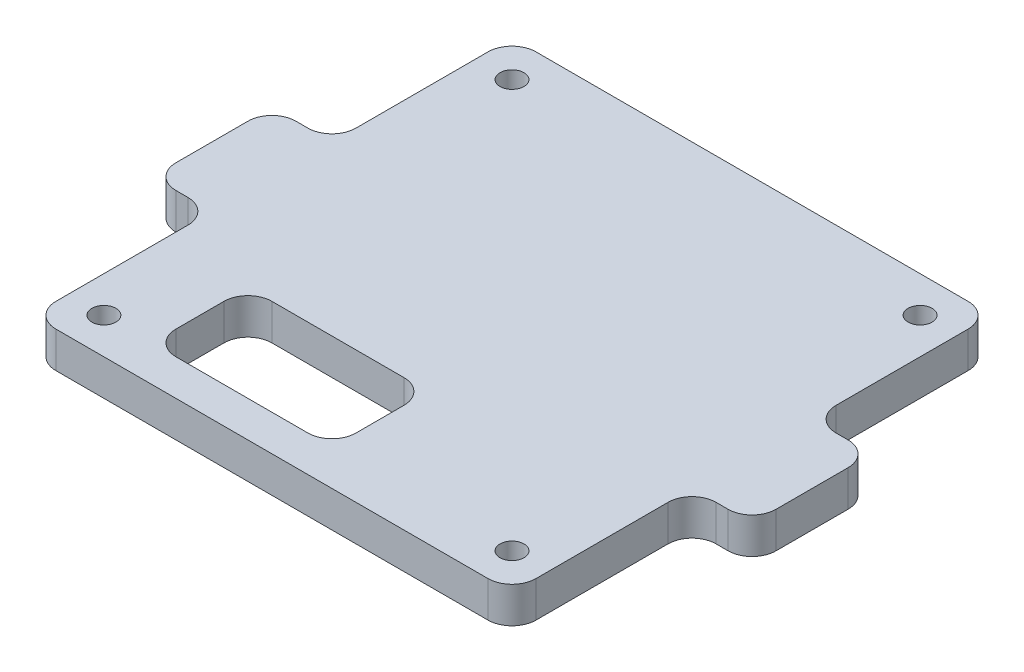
ISO-10303-21;
HEADER;
FILE_DESCRIPTION(('STEP AP214'),'2;1');
FILE_NAME('part.step','',(''),(''),'','','');
FILE_SCHEMA(('AUTOMOTIVE_DESIGN { 1 0 10303 214 1 1 1 1 }'));
ENDSEC;
DATA;
#1=APPLICATION_CONTEXT('core data for automotive mechanical design processes');
#2=APPLICATION_PROTOCOL_DEFINITION('international standard','automotive_design',2000,#1);
#3=PRODUCT_CONTEXT('',#1,'mechanical');
#4=PRODUCT('Part','Part','',(#3));
#5=PRODUCT_RELATED_PRODUCT_CATEGORY('part','',(#4));
#6=PRODUCT_DEFINITION_FORMATION('','',#4);
#7=PRODUCT_DEFINITION_CONTEXT('part definition',#1,'design');
#8=PRODUCT_DEFINITION('design','',#6,#7);
#9=PRODUCT_DEFINITION_SHAPE('','',#8);
#10=(LENGTH_UNIT() NAMED_UNIT(*) SI_UNIT(.MILLI.,.METRE.));
#11=(NAMED_UNIT(*) PLANE_ANGLE_UNIT() SI_UNIT($,.RADIAN.));
#12=(NAMED_UNIT(*) SI_UNIT($,.STERADIAN.) SOLID_ANGLE_UNIT());
#13=UNCERTAINTY_MEASURE_WITH_UNIT(LENGTH_MEASURE(1.E-05),#10,'distance_accuracy_value','');
#14=(GEOMETRIC_REPRESENTATION_CONTEXT(3) GLOBAL_UNCERTAINTY_ASSIGNED_CONTEXT((#13)) GLOBAL_UNIT_ASSIGNED_CONTEXT((#10,
#11,#12)) REPRESENTATION_CONTEXT('',''));
#15=CARTESIAN_POINT('',(0.,0.,0.));
#16=DIRECTION('',(0.,0.,1.));
#17=DIRECTION('',(1.,0.,0.));
#18=AXIS2_PLACEMENT_3D('',#15,#16,#17);
#19=CARTESIAN_POINT('',(0.,3.,0.));
#20=DIRECTION('',(0.,1.,0.));
#21=DIRECTION('',(0.,0.,1.));
#22=AXIS2_PLACEMENT_3D('',#19,#20,#21);
#23=PLANE('',#22);
#24=CARTESIAN_POINT('',(17.,3.,17.));
#25=DIRECTION('',(0.,1.,0.));
#26=DIRECTION('',(0.,0.,1.));
#27=AXIS2_PLACEMENT_3D('',#24,#25,#26);
#28=CIRCLE('',#27,1.);
#29=CARTESIAN_POINT('',(17.,3.,18.));
#30=VERTEX_POINT('',#29);
#31=EDGE_CURVE('E595',#30,#30,#28,.T.);
#32=ORIENTED_EDGE('',*,*,#31,.F.);
#33=EDGE_LOOP('',(#32));
#34=FACE_BOUND('',#33,.T.);
#35=CARTESIAN_POINT('',(17.,3.,-17.));
#36=DIRECTION('',(0.,1.,0.));
#37=DIRECTION('',(0.,0.,-1.));
#38=AXIS2_PLACEMENT_3D('',#35,#36,#37);
#39=CIRCLE('',#38,1.);
#40=CARTESIAN_POINT('',(17.,3.,-18.));
#41=VERTEX_POINT('',#40);
#42=EDGE_CURVE('E607',#41,#41,#39,.T.);
#43=ORIENTED_EDGE('',*,*,#42,.F.);
#44=EDGE_LOOP('',(#43));
#45=FACE_BOUND('',#44,.T.);
#46=DIRECTION('',(-1.,0.,0.));
#47=VECTOR('',#46,1.);
#48=CARTESIAN_POINT('',(20.,3.,-20.));
#49=LINE('',#48,#47);
#50=CARTESIAN_POINT('',(18.,3.,-20.));
#51=VERTEX_POINT('',#50);
#52=CARTESIAN_POINT('',(-18.,3.,-20.));
#53=VERTEX_POINT('',#52);
#54=EDGE_CURVE('E268',#51,#53,#49,.T.);
#55=ORIENTED_EDGE('',*,*,#54,.T.);
#56=CARTESIAN_POINT('',(-18.,3.,-18.));
#57=DIRECTION('',(0.,1.,0.));
#58=DIRECTION('',(0.,0.,1.));
#59=AXIS2_PLACEMENT_3D('',#56,#57,#58);
#60=CIRCLE('',#59,2.);
#61=CARTESIAN_POINT('',(-20.,3.,-18.));
#62=VERTEX_POINT('',#61);
#63=EDGE_CURVE('E332',#53,#62,#60,.T.);
#64=ORIENTED_EDGE('',*,*,#63,.T.);
#65=DIRECTION('',(0.,0.,1.));
#66=VECTOR('',#65,1.);
#67=CARTESIAN_POINT('',(-20.,3.,-5.));
#68=LINE('',#67,#66);
#69=CARTESIAN_POINT('',(-20.,3.,-7.));
#70=VERTEX_POINT('',#69);
#71=EDGE_CURVE('E430',#62,#70,#68,.T.);
#72=ORIENTED_EDGE('',*,*,#71,.T.);
#73=CARTESIAN_POINT('',(-22.,3.,-7.));
#74=DIRECTION('',(0.,1.,0.));
#75=DIRECTION('',(0.,0.,1.));
#76=AXIS2_PLACEMENT_3D('',#73,#74,#75);
#77=CIRCLE('',#76,2.);
#78=CARTESIAN_POINT('',(-22.,3.,-5.));
#79=VERTEX_POINT('',#78);
#80=EDGE_CURVE('E11',#70,#79,#77,.F.);
#81=ORIENTED_EDGE('',*,*,#80,.T.);
#82=DIRECTION('',(-1.,0.,0.));
#83=VECTOR('',#82,1.);
#84=CARTESIAN_POINT('',(-20.,3.,-5.));
#85=LINE('',#84,#83);
#86=CARTESIAN_POINT('',(-23.,3.,-5.));
#87=VERTEX_POINT('',#86);
#88=EDGE_CURVE('E428',#79,#87,#85,.T.);
#89=ORIENTED_EDGE('',*,*,#88,.T.);
#90=CARTESIAN_POINT('',(-23.,3.,-3.));
#91=DIRECTION('',(0.,1.,0.));
#92=DIRECTION('',(0.,0.,1.));
#93=AXIS2_PLACEMENT_3D('',#90,#91,#92);
#94=CIRCLE('',#93,2.);
#95=CARTESIAN_POINT('',(-25.,3.,-3.));
#96=VERTEX_POINT('',#95);
#97=EDGE_CURVE('E320',#87,#96,#94,.T.);
#98=ORIENTED_EDGE('',*,*,#97,.T.);
#99=DIRECTION('',(0.,0.,1.));
#100=VECTOR('',#99,1.);
#101=CARTESIAN_POINT('',(-25.,3.,5.));
#102=LINE('',#101,#100);
#103=CARTESIAN_POINT('',(-25.,3.,3.));
#104=VERTEX_POINT('',#103);
#105=EDGE_CURVE('E434',#96,#104,#102,.T.);
#106=ORIENTED_EDGE('',*,*,#105,.T.);
#107=CARTESIAN_POINT('',(-23.,3.,3.));
#108=DIRECTION('',(0.,1.,0.));
#109=DIRECTION('',(0.,0.,1.));
#110=AXIS2_PLACEMENT_3D('',#107,#108,#109);
#111=CIRCLE('',#110,2.);
#112=CARTESIAN_POINT('',(-23.,3.,5.));
#113=VERTEX_POINT('',#112);
#114=EDGE_CURVE('E322',#104,#113,#111,.T.);
#115=ORIENTED_EDGE('',*,*,#114,.T.);
#116=DIRECTION('',(1.,0.,0.));
#117=VECTOR('',#116,1.);
#118=CARTESIAN_POINT('',(-25.,3.,5.));
#119=LINE('',#118,#117);
#120=CARTESIAN_POINT('',(-22.,3.,5.));
#121=VERTEX_POINT('',#120);
#122=EDGE_CURVE('E437',#113,#121,#119,.T.);
#123=ORIENTED_EDGE('',*,*,#122,.T.);
#124=CARTESIAN_POINT('',(-22.,3.,7.));
#125=DIRECTION('',(0.,1.,0.));
#126=DIRECTION('',(0.,0.,1.));
#127=AXIS2_PLACEMENT_3D('',#124,#125,#126);
#128=CIRCLE('',#127,2.);
#129=CARTESIAN_POINT('',(-20.,3.,7.));
#130=VERTEX_POINT('',#129);
#131=EDGE_CURVE('E404',#121,#130,#128,.F.);
#132=ORIENTED_EDGE('',*,*,#131,.T.);
#133=DIRECTION('',(0.,0.,1.));
#134=VECTOR('',#133,1.);
#135=CARTESIAN_POINT('',(-20.,3.,20.));
#136=LINE('',#135,#134);
#137=CARTESIAN_POINT('',(-20.,3.,18.));
#138=VERTEX_POINT('',#137);
#139=EDGE_CURVE('E444',#130,#138,#136,.T.);
#140=ORIENTED_EDGE('',*,*,#139,.T.);
#141=CARTESIAN_POINT('',(-18.,3.,18.));
#142=DIRECTION('',(0.,1.,0.));
#143=DIRECTION('',(0.,0.,1.));
#144=AXIS2_PLACEMENT_3D('',#141,#142,#143);
#145=CIRCLE('',#144,2.);
#146=CARTESIAN_POINT('',(-18.,3.,20.));
#147=VERTEX_POINT('',#146);
#148=EDGE_CURVE('E324',#138,#147,#145,.T.);
#149=ORIENTED_EDGE('',*,*,#148,.T.);
#150=DIRECTION('',(1.,0.,0.));
#151=VECTOR('',#150,1.);
#152=CARTESIAN_POINT('',(20.,3.,20.));
#153=LINE('',#152,#151);
#154=CARTESIAN_POINT('',(18.,3.,20.));
#155=VERTEX_POINT('',#154);
#156=EDGE_CURVE('E447',#147,#155,#153,.T.);
#157=ORIENTED_EDGE('',*,*,#156,.T.);
#158=CARTESIAN_POINT('',(18.,3.,18.));
#159=DIRECTION('',(0.,1.,0.));
#160=DIRECTION('',(0.,0.,1.));
#161=AXIS2_PLACEMENT_3D('',#158,#159,#160);
#162=CIRCLE('',#161,2.);
#163=CARTESIAN_POINT('',(20.,3.,18.));
#164=VERTEX_POINT('',#163);
#165=EDGE_CURVE('E326',#155,#164,#162,.T.);
#166=ORIENTED_EDGE('',*,*,#165,.T.);
#167=DIRECTION('',(0.,0.,-1.));
#168=VECTOR('',#167,1.);
#169=CARTESIAN_POINT('',(20.,3.,20.));
#170=LINE('',#169,#168);
#171=CARTESIAN_POINT('',(20.,3.,7.));
#172=VERTEX_POINT('',#171);
#173=EDGE_CURVE('E450',#164,#172,#170,.T.);
#174=ORIENTED_EDGE('',*,*,#173,.T.);
#175=CARTESIAN_POINT('',(22.,3.,7.));
#176=DIRECTION('',(0.,1.,0.));
#177=DIRECTION('',(0.,0.,1.));
#178=AXIS2_PLACEMENT_3D('',#175,#176,#177);
#179=CIRCLE('',#178,2.);
#180=CARTESIAN_POINT('',(22.,3.,5.));
#181=VERTEX_POINT('',#180);
#182=EDGE_CURVE('E400',#172,#181,#179,.F.);
#183=ORIENTED_EDGE('',*,*,#182,.T.);
#184=DIRECTION('',(1.,0.,0.));
#185=VECTOR('',#184,1.);
#186=CARTESIAN_POINT('',(25.,3.,5.));
#187=LINE('',#186,#185);
#188=CARTESIAN_POINT('',(23.,3.,5.));
#189=VERTEX_POINT('',#188);
#190=EDGE_CURVE('E453',#181,#189,#187,.T.);
#191=ORIENTED_EDGE('',*,*,#190,.T.);
#192=CARTESIAN_POINT('',(23.,3.,3.));
#193=DIRECTION('',(0.,1.,0.));
#194=DIRECTION('',(0.,0.,1.));
#195=AXIS2_PLACEMENT_3D('',#192,#193,#194);
#196=CIRCLE('',#195,2.);
#197=CARTESIAN_POINT('',(25.,3.,3.));
#198=VERTEX_POINT('',#197);
#199=EDGE_CURVE('E328',#189,#198,#196,.T.);
#200=ORIENTED_EDGE('',*,*,#199,.T.);
#201=DIRECTION('',(0.,0.,-1.));
#202=VECTOR('',#201,1.);
#203=CARTESIAN_POINT('',(25.,3.,5.));
#204=LINE('',#203,#202);
#205=CARTESIAN_POINT('',(25.,3.,-3.));
#206=VERTEX_POINT('',#205);
#207=EDGE_CURVE('E456',#198,#206,#204,.T.);
#208=ORIENTED_EDGE('',*,*,#207,.T.);
#209=CARTESIAN_POINT('',(23.,3.,-3.));
#210=DIRECTION('',(0.,1.,0.));
#211=DIRECTION('',(0.,0.,1.));
#212=AXIS2_PLACEMENT_3D('',#209,#210,#211);
#213=CIRCLE('',#212,2.);
#214=CARTESIAN_POINT('',(23.,3.,-5.));
#215=VERTEX_POINT('',#214);
#216=EDGE_CURVE('E330',#206,#215,#213,.T.);
#217=ORIENTED_EDGE('',*,*,#216,.T.);
#218=DIRECTION('',(-1.,0.,0.));
#219=VECTOR('',#218,1.);
#220=CARTESIAN_POINT('',(25.,3.,-5.));
#221=LINE('',#220,#219);
#222=CARTESIAN_POINT('',(22.,3.,-5.));
#223=VERTEX_POINT('',#222);
#224=EDGE_CURVE('E459',#215,#223,#221,.T.);
#225=ORIENTED_EDGE('',*,*,#224,.T.);
#226=CARTESIAN_POINT('',(22.,3.,-7.));
#227=DIRECTION('',(0.,1.,0.));
#228=DIRECTION('',(0.,0.,1.));
#229=AXIS2_PLACEMENT_3D('',#226,#227,#228);
#230=CIRCLE('',#229,2.);
#231=CARTESIAN_POINT('',(20.,3.,-7.));
#232=VERTEX_POINT('',#231);
#233=EDGE_CURVE('E54',#223,#232,#230,.F.);
#234=ORIENTED_EDGE('',*,*,#233,.T.);
#235=DIRECTION('',(0.,0.,-1.));
#236=VECTOR('',#235,1.);
#237=CARTESIAN_POINT('',(20.,3.,-5.));
#238=LINE('',#237,#236);
#239=CARTESIAN_POINT('',(20.,3.,-18.));
#240=VERTEX_POINT('',#239);
#241=EDGE_CURVE('E273',#232,#240,#238,.T.);
#242=ORIENTED_EDGE('',*,*,#241,.T.);
#243=CARTESIAN_POINT('',(18.,3.,-18.));
#244=DIRECTION('',(0.,1.,0.));
#245=DIRECTION('',(0.,0.,1.));
#246=AXIS2_PLACEMENT_3D('',#243,#244,#245);
#247=CIRCLE('',#246,2.);
#248=EDGE_CURVE('E318',#240,#51,#247,.T.);
#249=ORIENTED_EDGE('',*,*,#248,.T.);
#250=EDGE_LOOP('',(#55,#64,#72,#81,#89,#98,#106,#115,#123,#132,#140,#149,#157,#166,#174,#183,
#191,#200,#208,#217,#225,#234,#242,#249));
#251=FACE_BOUND('',#250,.T.);
#252=CARTESIAN_POINT('',(-17.,3.,-17.));
#253=DIRECTION('',(0.,1.,0.));
#254=DIRECTION('',(0.,0.,1.));
#255=AXIS2_PLACEMENT_3D('',#252,#253,#254);
#256=CIRCLE('',#255,1.);
#257=CARTESIAN_POINT('',(-17.,3.,-16.));
#258=VERTEX_POINT('',#257);
#259=EDGE_CURVE('E421',#258,#258,#256,.T.);
#260=ORIENTED_EDGE('',*,*,#259,.F.);
#261=EDGE_LOOP('',(#260));
#262=FACE_BOUND('',#261,.T.);
#263=CARTESIAN_POINT('',(-17.,3.,17.));
#264=DIRECTION('',(0.,1.,0.));
#265=DIRECTION('',(0.,0.,-1.));
#266=AXIS2_PLACEMENT_3D('',#263,#264,#265);
#267=CIRCLE('',#266,1.);
#268=CARTESIAN_POINT('',(-17.,3.,16.));
#269=VERTEX_POINT('',#268);
#270=EDGE_CURVE('E601',#269,#269,#267,.T.);
#271=ORIENTED_EDGE('',*,*,#270,.F.);
#272=EDGE_LOOP('',(#271));
#273=FACE_BOUND('',#272,.T.);
#274=DIRECTION('',(1.,0.,0.));
#275=VECTOR('',#274,1.);
#276=CARTESIAN_POINT('',(-13.,3.,17.));
#277=LINE('',#276,#275);
#278=CARTESIAN_POINT('',(-11.,3.,17.));
#279=VERTEX_POINT('',#278);
#280=CARTESIAN_POINT('',(0.,3.,17.));
#281=VERTEX_POINT('',#280);
#282=EDGE_CURVE('E586',#279,#281,#277,.T.);
#283=ORIENTED_EDGE('',*,*,#282,.F.);
#284=CARTESIAN_POINT('',(-11.,3.,15.));
#285=DIRECTION('',(0.,1.,0.));
#286=DIRECTION('',(0.,0.,1.));
#287=AXIS2_PLACEMENT_3D('',#284,#285,#286);
#288=CIRCLE('',#287,2.);
#289=CARTESIAN_POINT('',(-13.,3.,15.));
#290=VERTEX_POINT('',#289);
#291=EDGE_CURVE('E253',#279,#290,#288,.F.);
#292=ORIENTED_EDGE('',*,*,#291,.T.);
#293=DIRECTION('',(0.,0.,1.));
#294=VECTOR('',#293,1.);
#295=CARTESIAN_POINT('',(-13.,3.,17.));
#296=LINE('',#295,#294);
#297=CARTESIAN_POINT('',(-13.,3.,11.));
#298=VERTEX_POINT('',#297);
#299=EDGE_CURVE('E572',#298,#290,#296,.T.);
#300=ORIENTED_EDGE('',*,*,#299,.F.);
#301=CARTESIAN_POINT('',(-11.,3.,11.));
#302=DIRECTION('',(0.,1.,0.));
#303=DIRECTION('',(0.,0.,1.));
#304=AXIS2_PLACEMENT_3D('',#301,#302,#303);
#305=CIRCLE('',#304,2.);
#306=CARTESIAN_POINT('',(-11.,3.,9.00000000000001));
#307=VERTEX_POINT('',#306);
#308=EDGE_CURVE('E254',#298,#307,#305,.F.);
#309=ORIENTED_EDGE('',*,*,#308,.T.);
#310=DIRECTION('',(-1.,0.,0.));
#311=VECTOR('',#310,1.);
#312=CARTESIAN_POINT('',(-13.,3.,9.00000000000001));
#313=LINE('',#312,#311);
#314=CARTESIAN_POINT('',(0.,3.,9.00000000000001));
#315=VERTEX_POINT('',#314);
#316=EDGE_CURVE('E582',#315,#307,#313,.T.);
#317=ORIENTED_EDGE('',*,*,#316,.F.);
#318=CARTESIAN_POINT('',(0.,3.,11.));
#319=DIRECTION('',(0.,1.,0.));
#320=DIRECTION('',(0.,0.,1.));
#321=AXIS2_PLACEMENT_3D('',#318,#319,#320);
#322=CIRCLE('',#321,2.);
#323=CARTESIAN_POINT('',(2.,3.,11.));
#324=VERTEX_POINT('',#323);
#325=EDGE_CURVE('E389',#315,#324,#322,.F.);
#326=ORIENTED_EDGE('',*,*,#325,.T.);
#327=DIRECTION('',(0.,0.,-1.));
#328=VECTOR('',#327,1.);
#329=CARTESIAN_POINT('',(2.,3.,17.));
#330=LINE('',#329,#328);
#331=CARTESIAN_POINT('',(2.,3.,15.));
#332=VERTEX_POINT('',#331);
#333=EDGE_CURVE('E580',#332,#324,#330,.T.);
#334=ORIENTED_EDGE('',*,*,#333,.F.);
#335=CARTESIAN_POINT('',(0.,3.,15.));
#336=DIRECTION('',(0.,1.,0.));
#337=DIRECTION('',(0.,0.,1.));
#338=AXIS2_PLACEMENT_3D('',#335,#336,#337);
#339=CIRCLE('',#338,2.);
#340=EDGE_CURVE('E385',#332,#281,#339,.F.);
#341=ORIENTED_EDGE('',*,*,#340,.T.);
#342=EDGE_LOOP('',(#283,#292,#300,#309,#317,#326,#334,#341));
#343=FACE_BOUND('',#342,.T.);
#344=ADVANCED_FACE('F32',(#34,#45,#251,#262,#273,#343),#23,.T.);
#345=CARTESIAN_POINT('',(0.,0.,0.));
#346=DIRECTION('',(0.,1.,0.));
#347=DIRECTION('',(0.,0.,1.));
#348=AXIS2_PLACEMENT_3D('',#345,#346,#347);
#349=PLANE('',#348);
#350=CARTESIAN_POINT('',(17.,0.,17.));
#351=DIRECTION('',(0.,1.,0.));
#352=DIRECTION('',(0.,0.,1.));
#353=AXIS2_PLACEMENT_3D('',#350,#351,#352);
#354=CIRCLE('',#353,1.);
#355=CARTESIAN_POINT('',(17.,0.,18.));
#356=VERTEX_POINT('',#355);
#357=EDGE_CURVE('E588',#356,#356,#354,.T.);
#358=ORIENTED_EDGE('',*,*,#357,.T.);
#359=EDGE_LOOP('',(#358));
#360=FACE_BOUND('',#359,.T.);
#361=CARTESIAN_POINT('',(17.,0.,-17.));
#362=DIRECTION('',(0.,1.,0.));
#363=DIRECTION('',(0.,0.,-1.));
#364=AXIS2_PLACEMENT_3D('',#361,#362,#363);
#365=CIRCLE('',#364,1.);
#366=CARTESIAN_POINT('',(17.,0.,-18.));
#367=VERTEX_POINT('',#366);
#368=EDGE_CURVE('E604',#367,#367,#365,.T.);
#369=ORIENTED_EDGE('',*,*,#368,.T.);
#370=EDGE_LOOP('',(#369));
#371=FACE_BOUND('',#370,.T.);
#372=DIRECTION('',(0.,0.,1.));
#373=VECTOR('',#372,1.);
#374=CARTESIAN_POINT('',(-20.,0.,-5.));
#375=LINE('',#374,#373);
#376=CARTESIAN_POINT('',(-20.,0.,-18.));
#377=VERTEX_POINT('',#376);
#378=CARTESIAN_POINT('',(-20.,0.,-7.));
#379=VERTEX_POINT('',#378);
#380=EDGE_CURVE('E410',#377,#379,#375,.T.);
#381=ORIENTED_EDGE('',*,*,#380,.F.);
#382=CARTESIAN_POINT('',(-18.,0.,-18.));
#383=DIRECTION('',(0.,1.,0.));
#384=DIRECTION('',(0.,0.,1.));
#385=AXIS2_PLACEMENT_3D('',#382,#383,#384);
#386=CIRCLE('',#385,2.);
#387=CARTESIAN_POINT('',(-18.,0.,-20.));
#388=VERTEX_POINT('',#387);
#389=EDGE_CURVE('E311',#377,#388,#386,.F.);
#390=ORIENTED_EDGE('',*,*,#389,.T.);
#391=DIRECTION('',(-1.,0.,0.));
#392=VECTOR('',#391,1.);
#393=CARTESIAN_POINT('',(20.,0.,-20.));
#394=LINE('',#393,#392);
#395=CARTESIAN_POINT('',(18.,0.,-20.));
#396=VERTEX_POINT('',#395);
#397=EDGE_CURVE('E276',#396,#388,#394,.T.);
#398=ORIENTED_EDGE('',*,*,#397,.F.);
#399=CARTESIAN_POINT('',(18.,0.,-18.));
#400=DIRECTION('',(0.,1.,0.));
#401=DIRECTION('',(0.,0.,1.));
#402=AXIS2_PLACEMENT_3D('',#399,#400,#401);
#403=CIRCLE('',#402,2.);
#404=CARTESIAN_POINT('',(20.,0.,-18.));
#405=VERTEX_POINT('',#404);
#406=EDGE_CURVE('E297',#396,#405,#403,.F.);
#407=ORIENTED_EDGE('',*,*,#406,.T.);
#408=DIRECTION('',(0.,0.,-1.));
#409=VECTOR('',#408,1.);
#410=CARTESIAN_POINT('',(20.,0.,-5.));
#411=LINE('',#410,#409);
#412=CARTESIAN_POINT('',(20.,0.,-7.));
#413=VERTEX_POINT('',#412);
#414=EDGE_CURVE('E486',#413,#405,#411,.T.);
#415=ORIENTED_EDGE('',*,*,#414,.F.);
#416=CARTESIAN_POINT('',(22.,0.,-7.));
#417=DIRECTION('',(0.,1.,0.));
#418=DIRECTION('',(0.,0.,1.));
#419=AXIS2_PLACEMENT_3D('',#416,#417,#418);
#420=CIRCLE('',#419,2.);
#421=CARTESIAN_POINT('',(22.,0.,-5.));
#422=VERTEX_POINT('',#421);
#423=EDGE_CURVE('E395',#413,#422,#420,.T.);
#424=ORIENTED_EDGE('',*,*,#423,.T.);
#425=DIRECTION('',(-1.,0.,0.));
#426=VECTOR('',#425,1.);
#427=CARTESIAN_POINT('',(25.,0.,-5.));
#428=LINE('',#427,#426);
#429=CARTESIAN_POINT('',(23.,0.,-5.));
#430=VERTEX_POINT('',#429);
#431=EDGE_CURVE('E484',#430,#422,#428,.T.);
#432=ORIENTED_EDGE('',*,*,#431,.F.);
#433=CARTESIAN_POINT('',(23.,0.,-3.));
#434=DIRECTION('',(0.,1.,0.));
#435=DIRECTION('',(0.,0.,1.));
#436=AXIS2_PLACEMENT_3D('',#433,#434,#435);
#437=CIRCLE('',#436,2.);
#438=CARTESIAN_POINT('',(25.,0.,-3.));
#439=VERTEX_POINT('',#438);
#440=EDGE_CURVE('E309',#430,#439,#437,.F.);
#441=ORIENTED_EDGE('',*,*,#440,.T.);
#442=DIRECTION('',(0.,0.,-1.));
#443=VECTOR('',#442,1.);
#444=CARTESIAN_POINT('',(25.,0.,5.));
#445=LINE('',#444,#443);
#446=CARTESIAN_POINT('',(25.,0.,3.));
#447=VERTEX_POINT('',#446);
#448=EDGE_CURVE('E481',#447,#439,#445,.T.);
#449=ORIENTED_EDGE('',*,*,#448,.F.);
#450=CARTESIAN_POINT('',(23.,0.,3.));
#451=DIRECTION('',(0.,1.,0.));
#452=DIRECTION('',(0.,0.,1.));
#453=AXIS2_PLACEMENT_3D('',#450,#451,#452);
#454=CIRCLE('',#453,2.);
#455=CARTESIAN_POINT('',(23.,0.,5.));
#456=VERTEX_POINT('',#455);
#457=EDGE_CURVE('E307',#447,#456,#454,.F.);
#458=ORIENTED_EDGE('',*,*,#457,.T.);
#459=DIRECTION('',(1.,0.,0.));
#460=VECTOR('',#459,1.);
#461=CARTESIAN_POINT('',(25.,0.,5.));
#462=LINE('',#461,#460);
#463=CARTESIAN_POINT('',(22.,0.,5.));
#464=VERTEX_POINT('',#463);
#465=EDGE_CURVE('E478',#464,#456,#462,.T.);
#466=ORIENTED_EDGE('',*,*,#465,.F.);
#467=CARTESIAN_POINT('',(22.,0.,7.));
#468=DIRECTION('',(0.,1.,0.));
#469=DIRECTION('',(0.,0.,1.));
#470=AXIS2_PLACEMENT_3D('',#467,#468,#469);
#471=CIRCLE('',#470,2.);
#472=CARTESIAN_POINT('',(20.,0.,7.));
#473=VERTEX_POINT('',#472);
#474=EDGE_CURVE('E398',#464,#473,#471,.T.);
#475=ORIENTED_EDGE('',*,*,#474,.T.);
#476=DIRECTION('',(0.,0.,-1.));
#477=VECTOR('',#476,1.);
#478=CARTESIAN_POINT('',(20.,0.,20.));
#479=LINE('',#478,#477);
#480=CARTESIAN_POINT('',(20.,0.,18.));
#481=VERTEX_POINT('',#480);
#482=EDGE_CURVE('E475',#481,#473,#479,.T.);
#483=ORIENTED_EDGE('',*,*,#482,.F.);
#484=CARTESIAN_POINT('',(18.,0.,18.));
#485=DIRECTION('',(0.,1.,0.));
#486=DIRECTION('',(0.,0.,1.));
#487=AXIS2_PLACEMENT_3D('',#484,#485,#486);
#488=CIRCLE('',#487,2.);
#489=CARTESIAN_POINT('',(18.,0.,20.));
#490=VERTEX_POINT('',#489);
#491=EDGE_CURVE('E305',#481,#490,#488,.F.);
#492=ORIENTED_EDGE('',*,*,#491,.T.);
#493=DIRECTION('',(1.,0.,0.));
#494=VECTOR('',#493,1.);
#495=CARTESIAN_POINT('',(20.,0.,20.));
#496=LINE('',#495,#494);
#497=CARTESIAN_POINT('',(-18.,0.,20.));
#498=VERTEX_POINT('',#497);
#499=EDGE_CURVE('E472',#498,#490,#496,.T.);
#500=ORIENTED_EDGE('',*,*,#499,.F.);
#501=CARTESIAN_POINT('',(-18.,0.,18.));
#502=DIRECTION('',(0.,1.,0.));
#503=DIRECTION('',(0.,0.,1.));
#504=AXIS2_PLACEMENT_3D('',#501,#502,#503);
#505=CIRCLE('',#504,2.);
#506=CARTESIAN_POINT('',(-20.,0.,18.));
#507=VERTEX_POINT('',#506);
#508=EDGE_CURVE('E303',#498,#507,#505,.F.);
#509=ORIENTED_EDGE('',*,*,#508,.T.);
#510=DIRECTION('',(0.,0.,1.));
#511=VECTOR('',#510,1.);
#512=CARTESIAN_POINT('',(-20.,0.,20.));
#513=LINE('',#512,#511);
#514=CARTESIAN_POINT('',(-20.,0.,7.));
#515=VERTEX_POINT('',#514);
#516=EDGE_CURVE('E469',#515,#507,#513,.T.);
#517=ORIENTED_EDGE('',*,*,#516,.F.);
#518=CARTESIAN_POINT('',(-22.,0.,7.));
#519=DIRECTION('',(0.,1.,0.));
#520=DIRECTION('',(0.,0.,1.));
#521=AXIS2_PLACEMENT_3D('',#518,#519,#520);
#522=CIRCLE('',#521,2.);
#523=CARTESIAN_POINT('',(-22.,0.,5.));
#524=VERTEX_POINT('',#523);
#525=EDGE_CURVE('E402',#515,#524,#522,.T.);
#526=ORIENTED_EDGE('',*,*,#525,.T.);
#527=DIRECTION('',(1.,0.,0.));
#528=VECTOR('',#527,1.);
#529=CARTESIAN_POINT('',(-25.,0.,5.));
#530=LINE('',#529,#528);
#531=CARTESIAN_POINT('',(-23.,0.,5.));
#532=VERTEX_POINT('',#531);
#533=EDGE_CURVE('E466',#532,#524,#530,.T.);
#534=ORIENTED_EDGE('',*,*,#533,.F.);
#535=CARTESIAN_POINT('',(-23.,0.,3.));
#536=DIRECTION('',(0.,1.,0.));
#537=DIRECTION('',(0.,0.,1.));
#538=AXIS2_PLACEMENT_3D('',#535,#536,#537);
#539=CIRCLE('',#538,2.);
#540=CARTESIAN_POINT('',(-25.,0.,3.));
#541=VERTEX_POINT('',#540);
#542=EDGE_CURVE('E301',#532,#541,#539,.F.);
#543=ORIENTED_EDGE('',*,*,#542,.T.);
#544=DIRECTION('',(0.,0.,1.));
#545=VECTOR('',#544,1.);
#546=CARTESIAN_POINT('',(-25.,0.,5.));
#547=LINE('',#546,#545);
#548=CARTESIAN_POINT('',(-25.,0.,-3.));
#549=VERTEX_POINT('',#548);
#550=EDGE_CURVE('E463',#549,#541,#547,.T.);
#551=ORIENTED_EDGE('',*,*,#550,.F.);
#552=CARTESIAN_POINT('',(-23.,0.,-3.));
#553=DIRECTION('',(0.,1.,0.));
#554=DIRECTION('',(0.,0.,1.));
#555=AXIS2_PLACEMENT_3D('',#552,#553,#554);
#556=CIRCLE('',#555,2.);
#557=CARTESIAN_POINT('',(-23.,0.,-5.));
#558=VERTEX_POINT('',#557);
#559=EDGE_CURVE('E299',#549,#558,#556,.F.);
#560=ORIENTED_EDGE('',*,*,#559,.T.);
#561=DIRECTION('',(-1.,0.,0.));
#562=VECTOR('',#561,1.);
#563=CARTESIAN_POINT('',(-20.,0.,-5.));
#564=LINE('',#563,#562);
#565=CARTESIAN_POINT('',(-22.,0.,-5.));
#566=VERTEX_POINT('',#565);
#567=EDGE_CURVE('E412',#566,#558,#564,.T.);
#568=ORIENTED_EDGE('',*,*,#567,.F.);
#569=CARTESIAN_POINT('',(-22.,0.,-7.));
#570=DIRECTION('',(0.,1.,0.));
#571=DIRECTION('',(0.,0.,1.));
#572=AXIS2_PLACEMENT_3D('',#569,#570,#571);
#573=CIRCLE('',#572,2.);
#574=EDGE_CURVE('E40',#566,#379,#573,.T.);
#575=ORIENTED_EDGE('',*,*,#574,.T.);
#576=EDGE_LOOP('',(#381,#390,#398,#407,#415,#424,#432,#441,#449,#458,#466,#475,#483,#492,#500,
#509,#517,#526,#534,#543,#551,#560,#568,#575));
#577=FACE_BOUND('',#576,.T.);
#578=CARTESIAN_POINT('',(-17.,0.,-17.));
#579=DIRECTION('',(0.,1.,0.));
#580=DIRECTION('',(0.,0.,1.));
#581=AXIS2_PLACEMENT_3D('',#578,#579,#580);
#582=CIRCLE('',#581,1.);
#583=CARTESIAN_POINT('',(-17.,0.,-16.));
#584=VERTEX_POINT('',#583);
#585=EDGE_CURVE('E610',#584,#584,#582,.T.);
#586=ORIENTED_EDGE('',*,*,#585,.T.);
#587=EDGE_LOOP('',(#586));
#588=FACE_BOUND('',#587,.T.);
#589=CARTESIAN_POINT('',(-17.,0.,17.));
#590=DIRECTION('',(0.,1.,0.));
#591=DIRECTION('',(0.,0.,-1.));
#592=AXIS2_PLACEMENT_3D('',#589,#590,#591);
#593=CIRCLE('',#592,1.);
#594=CARTESIAN_POINT('',(-17.,0.,16.));
#595=VERTEX_POINT('',#594);
#596=EDGE_CURVE('E598',#595,#595,#593,.T.);
#597=ORIENTED_EDGE('',*,*,#596,.T.);
#598=EDGE_LOOP('',(#597));
#599=FACE_BOUND('',#598,.T.);
#600=DIRECTION('',(-1.,0.,0.));
#601=VECTOR('',#600,1.);
#602=CARTESIAN_POINT('',(-13.,0.,9.00000000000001));
#603=LINE('',#602,#601);
#604=CARTESIAN_POINT('',(0.,0.,9.00000000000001));
#605=VERTEX_POINT('',#604);
#606=CARTESIAN_POINT('',(-11.,0.,9.00000000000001));
#607=VERTEX_POINT('',#606);
#608=EDGE_CURVE('E567',#605,#607,#603,.T.);
#609=ORIENTED_EDGE('',*,*,#608,.T.);
#610=CARTESIAN_POINT('',(-11.,0.,11.));
#611=DIRECTION('',(0.,1.,0.));
#612=DIRECTION('',(0.,0.,1.));
#613=AXIS2_PLACEMENT_3D('',#610,#611,#612);
#614=CIRCLE('',#613,2.);
#615=CARTESIAN_POINT('',(-13.,0.,11.));
#616=VERTEX_POINT('',#615);
#617=EDGE_CURVE('E391',#607,#616,#614,.T.);
#618=ORIENTED_EDGE('',*,*,#617,.T.);
#619=DIRECTION('',(0.,0.,1.));
#620=VECTOR('',#619,1.);
#621=CARTESIAN_POINT('',(-13.,0.,17.));
#622=LINE('',#621,#620);
#623=CARTESIAN_POINT('',(-13.,0.,15.));
#624=VERTEX_POINT('',#623);
#625=EDGE_CURVE('E248',#616,#624,#622,.T.);
#626=ORIENTED_EDGE('',*,*,#625,.T.);
#627=CARTESIAN_POINT('',(-11.,0.,15.));
#628=DIRECTION('',(0.,1.,0.));
#629=DIRECTION('',(0.,0.,1.));
#630=AXIS2_PLACEMENT_3D('',#627,#628,#629);
#631=CIRCLE('',#630,2.);
#632=CARTESIAN_POINT('',(-11.,0.,17.));
#633=VERTEX_POINT('',#632);
#634=EDGE_CURVE('E242',#624,#633,#631,.T.);
#635=ORIENTED_EDGE('',*,*,#634,.T.);
#636=DIRECTION('',(1.,0.,0.));
#637=VECTOR('',#636,1.);
#638=CARTESIAN_POINT('',(-13.,0.,17.));
#639=LINE('',#638,#637);
#640=CARTESIAN_POINT('',(0.,0.,17.));
#641=VERTEX_POINT('',#640);
#642=EDGE_CURVE('E246',#633,#641,#639,.T.);
#643=ORIENTED_EDGE('',*,*,#642,.T.);
#644=CARTESIAN_POINT('',(0.,0.,15.));
#645=DIRECTION('',(0.,1.,0.));
#646=DIRECTION('',(0.,0.,1.));
#647=AXIS2_PLACEMENT_3D('',#644,#645,#646);
#648=CIRCLE('',#647,2.);
#649=CARTESIAN_POINT('',(2.,0.,15.));
#650=VERTEX_POINT('',#649);
#651=EDGE_CURVE('E383',#641,#650,#648,.T.);
#652=ORIENTED_EDGE('',*,*,#651,.T.);
#653=DIRECTION('',(0.,0.,-1.));
#654=VECTOR('',#653,1.);
#655=CARTESIAN_POINT('',(2.,0.,17.));
#656=LINE('',#655,#654);
#657=CARTESIAN_POINT('',(2.,0.,11.));
#658=VERTEX_POINT('',#657);
#659=EDGE_CURVE('E264',#650,#658,#656,.T.);
#660=ORIENTED_EDGE('',*,*,#659,.T.);
#661=CARTESIAN_POINT('',(0.,0.,11.));
#662=DIRECTION('',(0.,1.,0.));
#663=DIRECTION('',(0.,0.,1.));
#664=AXIS2_PLACEMENT_3D('',#661,#662,#663);
#665=CIRCLE('',#664,2.);
#666=EDGE_CURVE('E387',#658,#605,#665,.T.);
#667=ORIENTED_EDGE('',*,*,#666,.T.);
#668=EDGE_LOOP('',(#609,#618,#626,#635,#643,#652,#660,#667));
#669=FACE_BOUND('',#668,.T.);
#670=ADVANCED_FACE('F245',(#360,#371,#577,#588,#599,#669),#349,.F.);
#671=CARTESIAN_POINT('',(-20.,3.,-5.));
#672=DIRECTION('',(1.,0.,0.));
#673=DIRECTION('',(0.,0.,-1.));
#674=AXIS2_PLACEMENT_3D('',#671,#672,#673);
#675=PLANE('',#674);
#676=ORIENTED_EDGE('',*,*,#71,.F.);
#677=DIRECTION('',(0.,-1.,0.));
#678=VECTOR('',#677,1.);
#679=CARTESIAN_POINT('',(-20.,3.,-18.));
#680=LINE('',#679,#678);
#681=EDGE_CURVE('E294',#62,#377,#680,.T.);
#682=ORIENTED_EDGE('',*,*,#681,.T.);
#683=ORIENTED_EDGE('',*,*,#380,.T.);
#684=DIRECTION('',(0.,-1.,0.));
#685=VECTOR('',#684,1.);
#686=CARTESIAN_POINT('',(-20.,3.,-7.));
#687=LINE('',#686,#685);
#688=EDGE_CURVE('E292',#379,#70,#687,.F.);
#689=ORIENTED_EDGE('',*,*,#688,.T.);
#690=EDGE_LOOP('',(#676,#682,#683,#689));
#691=FACE_BOUND('',#690,.T.);
#692=ADVANCED_FACE('F418',(#691),#675,.F.);
#693=CARTESIAN_POINT('',(-20.,3.,-5.));
#694=DIRECTION('',(0.,0.,1.));
#695=DIRECTION('',(1.,0.,0.));
#696=AXIS2_PLACEMENT_3D('',#693,#694,#695);
#697=PLANE('',#696);
#698=ORIENTED_EDGE('',*,*,#567,.T.);
#699=DIRECTION('',(0.,-1.,0.));
#700=VECTOR('',#699,1.);
#701=CARTESIAN_POINT('',(-23.,3.,-5.));
#702=LINE('',#701,#700);
#703=EDGE_CURVE('E381',#558,#87,#702,.F.);
#704=ORIENTED_EDGE('',*,*,#703,.T.);
#705=ORIENTED_EDGE('',*,*,#88,.F.);
#706=DIRECTION('',(0.,-1.,0.));
#707=VECTOR('',#706,1.);
#708=CARTESIAN_POINT('',(-22.,0.,-5.));
#709=LINE('',#708,#707);
#710=EDGE_CURVE('E378',#79,#566,#709,.T.);
#711=ORIENTED_EDGE('',*,*,#710,.T.);
#712=EDGE_LOOP('',(#698,#704,#705,#711));
#713=FACE_BOUND('',#712,.T.);
#714=ADVANCED_FACE('F432',(#713),#697,.F.);
#715=CARTESIAN_POINT('',(-25.,3.,5.));
#716=DIRECTION('',(1.,0.,0.));
#717=DIRECTION('',(0.,0.,-1.));
#718=AXIS2_PLACEMENT_3D('',#715,#716,#717);
#719=PLANE('',#718);
#720=ORIENTED_EDGE('',*,*,#550,.T.);
#721=DIRECTION('',(0.,-1.,0.));
#722=VECTOR('',#721,1.);
#723=CARTESIAN_POINT('',(-25.,3.,3.));
#724=LINE('',#723,#722);
#725=EDGE_CURVE('E376',#541,#104,#724,.F.);
#726=ORIENTED_EDGE('',*,*,#725,.T.);
#727=ORIENTED_EDGE('',*,*,#105,.F.);
#728=DIRECTION('',(0.,-1.,0.));
#729=VECTOR('',#728,1.);
#730=CARTESIAN_POINT('',(-25.,3.,-3.));
#731=LINE('',#730,#729);
#732=EDGE_CURVE('E373',#96,#549,#731,.T.);
#733=ORIENTED_EDGE('',*,*,#732,.T.);
#734=EDGE_LOOP('',(#720,#726,#727,#733));
#735=FACE_BOUND('',#734,.T.);
#736=ADVANCED_FACE('F870',(#735),#719,.F.);
#737=CARTESIAN_POINT('',(-25.,3.,5.));
#738=DIRECTION('',(0.,0.,-1.));
#739=DIRECTION('',(-1.,0.,0.));
#740=AXIS2_PLACEMENT_3D('',#737,#738,#739);
#741=PLANE('',#740);
#742=ORIENTED_EDGE('',*,*,#533,.T.);
#743=DIRECTION('',(0.,-1.,0.));
#744=VECTOR('',#743,1.);
#745=CARTESIAN_POINT('',(-22.,3.,5.));
#746=LINE('',#745,#744);
#747=EDGE_CURVE('E371',#524,#121,#746,.F.);
#748=ORIENTED_EDGE('',*,*,#747,.T.);
#749=ORIENTED_EDGE('',*,*,#122,.F.);
#750=DIRECTION('',(0.,-1.,0.));
#751=VECTOR('',#750,1.);
#752=CARTESIAN_POINT('',(-23.,3.,5.));
#753=LINE('',#752,#751);
#754=EDGE_CURVE('E368',#113,#532,#753,.T.);
#755=ORIENTED_EDGE('',*,*,#754,.T.);
#756=EDGE_LOOP('',(#742,#748,#749,#755));
#757=FACE_BOUND('',#756,.T.);
#758=ADVANCED_FACE('F860',(#757),#741,.F.);
#759=CARTESIAN_POINT('',(-20.,3.,20.));
#760=DIRECTION('',(1.,0.,0.));
#761=DIRECTION('',(0.,0.,-1.));
#762=AXIS2_PLACEMENT_3D('',#759,#760,#761);
#763=PLANE('',#762);
#764=ORIENTED_EDGE('',*,*,#516,.T.);
#765=DIRECTION('',(0.,-1.,0.));
#766=VECTOR('',#765,1.);
#767=CARTESIAN_POINT('',(-20.,3.,18.));
#768=LINE('',#767,#766);
#769=EDGE_CURVE('E366',#507,#138,#768,.F.);
#770=ORIENTED_EDGE('',*,*,#769,.T.);
#771=ORIENTED_EDGE('',*,*,#139,.F.);
#772=DIRECTION('',(0.,-1.,0.));
#773=VECTOR('',#772,1.);
#774=CARTESIAN_POINT('',(-20.,0.,7.));
#775=LINE('',#774,#773);
#776=EDGE_CURVE('E363',#130,#515,#775,.T.);
#777=ORIENTED_EDGE('',*,*,#776,.T.);
#778=EDGE_LOOP('',(#764,#770,#771,#777));
#779=FACE_BOUND('',#778,.T.);
#780=ADVANCED_FACE('F850',(#779),#763,.F.);
#781=CARTESIAN_POINT('',(20.,3.,20.));
#782=DIRECTION('',(0.,0.,-1.));
#783=DIRECTION('',(-1.,0.,0.));
#784=AXIS2_PLACEMENT_3D('',#781,#782,#783);
#785=PLANE('',#784);
#786=ORIENTED_EDGE('',*,*,#499,.T.);
#787=DIRECTION('',(0.,-1.,0.));
#788=VECTOR('',#787,1.);
#789=CARTESIAN_POINT('',(18.,3.,20.));
#790=LINE('',#789,#788);
#791=EDGE_CURVE('E361',#490,#155,#790,.F.);
#792=ORIENTED_EDGE('',*,*,#791,.T.);
#793=ORIENTED_EDGE('',*,*,#156,.F.);
#794=DIRECTION('',(0.,-1.,0.));
#795=VECTOR('',#794,1.);
#796=CARTESIAN_POINT('',(-18.,3.,20.));
#797=LINE('',#796,#795);
#798=EDGE_CURVE('E358',#147,#498,#797,.T.);
#799=ORIENTED_EDGE('',*,*,#798,.T.);
#800=EDGE_LOOP('',(#786,#792,#793,#799));
#801=FACE_BOUND('',#800,.T.);
#802=ADVANCED_FACE('F840',(#801),#785,.F.);
#803=CARTESIAN_POINT('',(20.,3.,20.));
#804=DIRECTION('',(-1.,0.,0.));
#805=DIRECTION('',(0.,0.,1.));
#806=AXIS2_PLACEMENT_3D('',#803,#804,#805);
#807=PLANE('',#806);
#808=ORIENTED_EDGE('',*,*,#482,.T.);
#809=DIRECTION('',(0.,-1.,0.));
#810=VECTOR('',#809,1.);
#811=CARTESIAN_POINT('',(20.,3.,7.));
#812=LINE('',#811,#810);
#813=EDGE_CURVE('E356',#473,#172,#812,.F.);
#814=ORIENTED_EDGE('',*,*,#813,.T.);
#815=ORIENTED_EDGE('',*,*,#173,.F.);
#816=DIRECTION('',(0.,-1.,0.));
#817=VECTOR('',#816,1.);
#818=CARTESIAN_POINT('',(20.,3.,18.));
#819=LINE('',#818,#817);
#820=EDGE_CURVE('E353',#164,#481,#819,.T.);
#821=ORIENTED_EDGE('',*,*,#820,.T.);
#822=EDGE_LOOP('',(#808,#814,#815,#821));
#823=FACE_BOUND('',#822,.T.);
#824=ADVANCED_FACE('F830',(#823),#807,.F.);
#825=CARTESIAN_POINT('',(25.,3.,5.));
#826=DIRECTION('',(0.,0.,-1.));
#827=DIRECTION('',(-1.,0.,0.));
#828=AXIS2_PLACEMENT_3D('',#825,#826,#827);
#829=PLANE('',#828);
#830=ORIENTED_EDGE('',*,*,#465,.T.);
#831=DIRECTION('',(0.,-1.,0.));
#832=VECTOR('',#831,1.);
#833=CARTESIAN_POINT('',(23.,3.,5.));
#834=LINE('',#833,#832);
#835=EDGE_CURVE('E351',#456,#189,#834,.F.);
#836=ORIENTED_EDGE('',*,*,#835,.T.);
#837=ORIENTED_EDGE('',*,*,#190,.F.);
#838=DIRECTION('',(0.,-1.,0.));
#839=VECTOR('',#838,1.);
#840=CARTESIAN_POINT('',(22.,0.,5.));
#841=LINE('',#840,#839);
#842=EDGE_CURVE('E348',#181,#464,#841,.T.);
#843=ORIENTED_EDGE('',*,*,#842,.T.);
#844=EDGE_LOOP('',(#830,#836,#837,#843));
#845=FACE_BOUND('',#844,.T.);
#846=ADVANCED_FACE('F820',(#845),#829,.F.);
#847=CARTESIAN_POINT('',(25.,3.,5.));
#848=DIRECTION('',(-1.,0.,0.));
#849=DIRECTION('',(0.,0.,1.));
#850=AXIS2_PLACEMENT_3D('',#847,#848,#849);
#851=PLANE('',#850);
#852=ORIENTED_EDGE('',*,*,#448,.T.);
#853=DIRECTION('',(0.,-1.,0.));
#854=VECTOR('',#853,1.);
#855=CARTESIAN_POINT('',(25.,3.,-3.));
#856=LINE('',#855,#854);
#857=EDGE_CURVE('E346',#439,#206,#856,.F.);
#858=ORIENTED_EDGE('',*,*,#857,.T.);
#859=ORIENTED_EDGE('',*,*,#207,.F.);
#860=DIRECTION('',(0.,-1.,0.));
#861=VECTOR('',#860,1.);
#862=CARTESIAN_POINT('',(25.,3.,3.));
#863=LINE('',#862,#861);
#864=EDGE_CURVE('E343',#198,#447,#863,.T.);
#865=ORIENTED_EDGE('',*,*,#864,.T.);
#866=EDGE_LOOP('',(#852,#858,#859,#865));
#867=FACE_BOUND('',#866,.T.);
#868=ADVANCED_FACE('F518',(#867),#851,.F.);
#869=CARTESIAN_POINT('',(25.,3.,-5.));
#870=DIRECTION('',(0.,0.,1.));
#871=DIRECTION('',(1.,0.,0.));
#872=AXIS2_PLACEMENT_3D('',#869,#870,#871);
#873=PLANE('',#872);
#874=ORIENTED_EDGE('',*,*,#431,.T.);
#875=DIRECTION('',(0.,-1.,0.));
#876=VECTOR('',#875,1.);
#877=CARTESIAN_POINT('',(22.,3.,-5.));
#878=LINE('',#877,#876);
#879=EDGE_CURVE('E341',#422,#223,#878,.F.);
#880=ORIENTED_EDGE('',*,*,#879,.T.);
#881=ORIENTED_EDGE('',*,*,#224,.F.);
#882=DIRECTION('',(0.,-1.,0.));
#883=VECTOR('',#882,1.);
#884=CARTESIAN_POINT('',(23.,3.,-5.));
#885=LINE('',#884,#883);
#886=EDGE_CURVE('E338',#215,#430,#885,.T.);
#887=ORIENTED_EDGE('',*,*,#886,.T.);
#888=EDGE_LOOP('',(#874,#880,#881,#887));
#889=FACE_BOUND('',#888,.T.);
#890=ADVANCED_FACE('F505',(#889),#873,.F.);
#891=CARTESIAN_POINT('',(20.,3.,-5.));
#892=DIRECTION('',(-1.,0.,0.));
#893=DIRECTION('',(0.,0.,1.));
#894=AXIS2_PLACEMENT_3D('',#891,#892,#893);
#895=PLANE('',#894);
#896=ORIENTED_EDGE('',*,*,#241,.F.);
#897=DIRECTION('',(0.,-1.,0.));
#898=VECTOR('',#897,1.);
#899=CARTESIAN_POINT('',(20.,0.,-7.));
#900=LINE('',#899,#898);
#901=EDGE_CURVE('E335',#232,#413,#900,.T.);
#902=ORIENTED_EDGE('',*,*,#901,.T.);
#903=ORIENTED_EDGE('',*,*,#414,.T.);
#904=DIRECTION('',(0.,-1.,0.));
#905=VECTOR('',#904,1.);
#906=CARTESIAN_POINT('',(20.,3.,-18.));
#907=LINE('',#906,#905);
#908=EDGE_CURVE('E47',#405,#240,#907,.F.);
#909=ORIENTED_EDGE('',*,*,#908,.T.);
#910=EDGE_LOOP('',(#896,#902,#903,#909));
#911=FACE_BOUND('',#910,.T.);
#912=ADVANCED_FACE('F509',(#911),#895,.F.);
#913=CARTESIAN_POINT('',(20.,3.,-20.));
#914=DIRECTION('',(0.,0.,1.));
#915=DIRECTION('',(1.,0.,0.));
#916=AXIS2_PLACEMENT_3D('',#913,#914,#915);
#917=PLANE('',#916);
#918=ORIENTED_EDGE('',*,*,#397,.T.);
#919=DIRECTION('',(0.,-1.,0.));
#920=VECTOR('',#919,1.);
#921=CARTESIAN_POINT('',(-18.,3.,-20.));
#922=LINE('',#921,#920);
#923=EDGE_CURVE('E316',#388,#53,#922,.F.);
#924=ORIENTED_EDGE('',*,*,#923,.T.);
#925=ORIENTED_EDGE('',*,*,#54,.F.);
#926=DIRECTION('',(0.,-1.,0.));
#927=VECTOR('',#926,1.);
#928=CARTESIAN_POINT('',(18.,3.,-20.));
#929=LINE('',#928,#927);
#930=EDGE_CURVE('E313',#51,#396,#929,.T.);
#931=ORIENTED_EDGE('',*,*,#930,.T.);
#932=EDGE_LOOP('',(#918,#924,#925,#931));
#933=FACE_BOUND('',#932,.T.);
#934=ADVANCED_FACE('F492',(#933),#917,.F.);
#935=CARTESIAN_POINT('',(-17.,3.,-17.));
#936=DIRECTION('',(0.,-1.,0.));
#937=DIRECTION('',(0.,0.,-1.));
#938=AXIS2_PLACEMENT_3D('',#935,#936,#937);
#939=CYLINDRICAL_SURFACE('',#938,1.);
#940=ORIENTED_EDGE('',*,*,#259,.T.);
#941=EDGE_LOOP('',(#940));
#942=FACE_BOUND('',#941,.T.);
#943=ORIENTED_EDGE('',*,*,#585,.F.);
#944=EDGE_LOOP('',(#943));
#945=FACE_BOUND('',#944,.T.);
#946=ADVANCED_FACE('F516',(#942,#945),#939,.F.);
#947=CARTESIAN_POINT('',(17.,3.,-17.));
#948=DIRECTION('',(0.,-1.,0.));
#949=DIRECTION('',(0.,0.,-1.));
#950=AXIS2_PLACEMENT_3D('',#947,#948,#949);
#951=CYLINDRICAL_SURFACE('',#950,1.);
#952=ORIENTED_EDGE('',*,*,#42,.T.);
#953=EDGE_LOOP('',(#952));
#954=FACE_BOUND('',#953,.T.);
#955=ORIENTED_EDGE('',*,*,#368,.F.);
#956=EDGE_LOOP('',(#955));
#957=FACE_BOUND('',#956,.T.);
#958=ADVANCED_FACE('F533',(#954,#957),#951,.F.);
#959=CARTESIAN_POINT('',(-17.,3.,17.));
#960=DIRECTION('',(0.,-1.,0.));
#961=DIRECTION('',(0.,0.,-1.));
#962=AXIS2_PLACEMENT_3D('',#959,#960,#961);
#963=CYLINDRICAL_SURFACE('',#962,1.);
#964=ORIENTED_EDGE('',*,*,#270,.T.);
#965=EDGE_LOOP('',(#964));
#966=FACE_BOUND('',#965,.T.);
#967=ORIENTED_EDGE('',*,*,#596,.F.);
#968=EDGE_LOOP('',(#967));
#969=FACE_BOUND('',#968,.T.);
#970=ADVANCED_FACE('F537',(#966,#969),#963,.F.);
#971=CARTESIAN_POINT('',(17.,3.,17.));
#972=DIRECTION('',(0.,-1.,0.));
#973=DIRECTION('',(0.,0.,-1.));
#974=AXIS2_PLACEMENT_3D('',#971,#972,#973);
#975=CYLINDRICAL_SURFACE('',#974,1.);
#976=ORIENTED_EDGE('',*,*,#31,.T.);
#977=EDGE_LOOP('',(#976));
#978=FACE_BOUND('',#977,.T.);
#979=ORIENTED_EDGE('',*,*,#357,.F.);
#980=EDGE_LOOP('',(#979));
#981=FACE_BOUND('',#980,.T.);
#982=ADVANCED_FACE('F541',(#978,#981),#975,.F.);
#983=CARTESIAN_POINT('',(-13.,3.,17.));
#984=DIRECTION('',(1.,0.,0.));
#985=DIRECTION('',(0.,0.,-1.));
#986=AXIS2_PLACEMENT_3D('',#983,#984,#985);
#987=PLANE('',#986);
#988=ORIENTED_EDGE('',*,*,#625,.F.);
#989=DIRECTION('',(0.,-1.,0.));
#990=VECTOR('',#989,1.);
#991=CARTESIAN_POINT('',(-13.,3.,11.));
#992=LINE('',#991,#990);
#993=EDGE_CURVE('E290',#616,#298,#992,.F.);
#994=ORIENTED_EDGE('',*,*,#993,.T.);
#995=ORIENTED_EDGE('',*,*,#299,.T.);
#996=DIRECTION('',(0.,-1.,0.));
#997=VECTOR('',#996,1.);
#998=CARTESIAN_POINT('',(-13.,0.,15.));
#999=LINE('',#998,#997);
#1000=EDGE_CURVE('E288',#290,#624,#999,.T.);
#1001=ORIENTED_EDGE('',*,*,#1000,.T.);
#1002=EDGE_LOOP('',(#988,#994,#995,#1001));
#1003=FACE_BOUND('',#1002,.T.);
#1004=ADVANCED_FACE('F545',(#1003),#987,.T.);
#1005=CARTESIAN_POINT('',(-13.,3.,17.));
#1006=DIRECTION('',(0.,0.,-1.));
#1007=DIRECTION('',(-1.,0.,0.));
#1008=AXIS2_PLACEMENT_3D('',#1005,#1006,#1007);
#1009=PLANE('',#1008);
#1010=ORIENTED_EDGE('',*,*,#282,.T.);
#1011=DIRECTION('',(0.,-1.,0.));
#1012=VECTOR('',#1011,1.);
#1013=CARTESIAN_POINT('',(0.,0.,17.));
#1014=LINE('',#1013,#1012);
#1015=EDGE_CURVE('E263',#281,#641,#1014,.T.);
#1016=ORIENTED_EDGE('',*,*,#1015,.T.);
#1017=ORIENTED_EDGE('',*,*,#642,.F.);
#1018=DIRECTION('',(0.,-1.,0.));
#1019=VECTOR('',#1018,1.);
#1020=CARTESIAN_POINT('',(-11.,3.,17.));
#1021=LINE('',#1020,#1019);
#1022=EDGE_CURVE('E260',#633,#279,#1021,.F.);
#1023=ORIENTED_EDGE('',*,*,#1022,.T.);
#1024=EDGE_LOOP('',(#1010,#1016,#1017,#1023));
#1025=FACE_BOUND('',#1024,.T.);
#1026=ADVANCED_FACE('F259',(#1025),#1009,.T.);
#1027=CARTESIAN_POINT('',(2.,3.,17.));
#1028=DIRECTION('',(-1.,0.,0.));
#1029=DIRECTION('',(0.,0.,1.));
#1030=AXIS2_PLACEMENT_3D('',#1027,#1028,#1029);
#1031=PLANE('',#1030);
#1032=ORIENTED_EDGE('',*,*,#659,.F.);
#1033=DIRECTION('',(0.,-1.,0.));
#1034=VECTOR('',#1033,1.);
#1035=CARTESIAN_POINT('',(2.,3.,15.));
#1036=LINE('',#1035,#1034);
#1037=EDGE_CURVE('E281',#650,#332,#1036,.F.);
#1038=ORIENTED_EDGE('',*,*,#1037,.T.);
#1039=ORIENTED_EDGE('',*,*,#333,.T.);
#1040=DIRECTION('',(0.,-1.,0.));
#1041=VECTOR('',#1040,1.);
#1042=CARTESIAN_POINT('',(2.,0.,11.));
#1043=LINE('',#1042,#1041);
#1044=EDGE_CURVE('E270',#324,#658,#1043,.T.);
#1045=ORIENTED_EDGE('',*,*,#1044,.T.);
#1046=EDGE_LOOP('',(#1032,#1038,#1039,#1045));
#1047=FACE_BOUND('',#1046,.T.);
#1048=ADVANCED_FACE('F552',(#1047),#1031,.T.);
#1049=CARTESIAN_POINT('',(-13.,3.,9.00000000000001));
#1050=DIRECTION('',(0.,0.,1.));
#1051=DIRECTION('',(1.,0.,0.));
#1052=AXIS2_PLACEMENT_3D('',#1049,#1050,#1051);
#1053=PLANE('',#1052);
#1054=ORIENTED_EDGE('',*,*,#608,.F.);
#1055=DIRECTION('',(0.,-1.,0.));
#1056=VECTOR('',#1055,1.);
#1057=CARTESIAN_POINT('',(0.,3.,9.00000000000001));
#1058=LINE('',#1057,#1056);
#1059=EDGE_CURVE('E286',#605,#315,#1058,.F.);
#1060=ORIENTED_EDGE('',*,*,#1059,.T.);
#1061=ORIENTED_EDGE('',*,*,#316,.T.);
#1062=DIRECTION('',(0.,-1.,0.));
#1063=VECTOR('',#1062,1.);
#1064=CARTESIAN_POINT('',(-11.,0.,9.00000000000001));
#1065=LINE('',#1064,#1063);
#1066=EDGE_CURVE('E283',#307,#607,#1065,.T.);
#1067=ORIENTED_EDGE('',*,*,#1066,.T.);
#1068=EDGE_LOOP('',(#1054,#1060,#1061,#1067));
#1069=FACE_BOUND('',#1068,.T.);
#1070=ADVANCED_FACE('F555',(#1069),#1053,.T.);
#1071=CARTESIAN_POINT('',(0.,3.,15.));
#1072=DIRECTION('',(0.,1.,0.));
#1073=DIRECTION('',(0.,0.,1.));
#1074=AXIS2_PLACEMENT_3D('',#1071,#1072,#1073);
#1075=CYLINDRICAL_SURFACE('',#1074,2.);
#1076=ORIENTED_EDGE('',*,*,#340,.F.);
#1077=ORIENTED_EDGE('',*,*,#1037,.F.);
#1078=ORIENTED_EDGE('',*,*,#651,.F.);
#1079=ORIENTED_EDGE('',*,*,#1015,.F.);
#1080=EDGE_LOOP('',(#1076,#1077,#1078,#1079));
#1081=FACE_BOUND('',#1080,.T.);
#1082=ADVANCED_FACE('F558',(#1081),#1075,.F.);
#1083=CARTESIAN_POINT('',(0.,3.,11.));
#1084=DIRECTION('',(0.,1.,0.));
#1085=DIRECTION('',(0.,0.,1.));
#1086=AXIS2_PLACEMENT_3D('',#1083,#1084,#1085);
#1087=CYLINDRICAL_SURFACE('',#1086,2.);
#1088=ORIENTED_EDGE('',*,*,#325,.F.);
#1089=ORIENTED_EDGE('',*,*,#1059,.F.);
#1090=ORIENTED_EDGE('',*,*,#666,.F.);
#1091=ORIENTED_EDGE('',*,*,#1044,.F.);
#1092=EDGE_LOOP('',(#1088,#1089,#1090,#1091));
#1093=FACE_BOUND('',#1092,.T.);
#1094=ADVANCED_FACE('F563',(#1093),#1087,.F.);
#1095=CARTESIAN_POINT('',(-11.,3.,11.));
#1096=DIRECTION('',(0.,1.,0.));
#1097=DIRECTION('',(0.,0.,1.));
#1098=AXIS2_PLACEMENT_3D('',#1095,#1096,#1097);
#1099=CYLINDRICAL_SURFACE('',#1098,2.);
#1100=ORIENTED_EDGE('',*,*,#308,.F.);
#1101=ORIENTED_EDGE('',*,*,#993,.F.);
#1102=ORIENTED_EDGE('',*,*,#617,.F.);
#1103=ORIENTED_EDGE('',*,*,#1066,.F.);
#1104=EDGE_LOOP('',(#1100,#1101,#1102,#1103));
#1105=FACE_BOUND('',#1104,.T.);
#1106=ADVANCED_FACE('F634',(#1105),#1099,.F.);
#1107=CARTESIAN_POINT('',(-11.,3.,15.));
#1108=DIRECTION('',(0.,1.,0.));
#1109=DIRECTION('',(0.,0.,1.));
#1110=AXIS2_PLACEMENT_3D('',#1107,#1108,#1109);
#1111=CYLINDRICAL_SURFACE('',#1110,2.);
#1112=ORIENTED_EDGE('',*,*,#291,.F.);
#1113=ORIENTED_EDGE('',*,*,#1022,.F.);
#1114=ORIENTED_EDGE('',*,*,#634,.F.);
#1115=ORIENTED_EDGE('',*,*,#1000,.F.);
#1116=EDGE_LOOP('',(#1112,#1113,#1114,#1115));
#1117=FACE_BOUND('',#1116,.T.);
#1118=ADVANCED_FACE('F267',(#1117),#1111,.F.);
#1119=CARTESIAN_POINT('',(-18.,3.,-18.));
#1120=DIRECTION('',(0.,-1.,0.));
#1121=DIRECTION('',(0.,0.,-1.));
#1122=AXIS2_PLACEMENT_3D('',#1119,#1120,#1121);
#1123=CYLINDRICAL_SURFACE('',#1122,2.);
#1124=ORIENTED_EDGE('',*,*,#63,.F.);
#1125=ORIENTED_EDGE('',*,*,#923,.F.);
#1126=ORIENTED_EDGE('',*,*,#389,.F.);
#1127=ORIENTED_EDGE('',*,*,#681,.F.);
#1128=EDGE_LOOP('',(#1124,#1125,#1126,#1127));
#1129=FACE_BOUND('',#1128,.T.);
#1130=ADVANCED_FACE('F497',(#1129),#1123,.T.);
#1131=CARTESIAN_POINT('',(22.,3.,-7.));
#1132=DIRECTION('',(0.,1.,0.));
#1133=DIRECTION('',(0.,0.,1.));
#1134=AXIS2_PLACEMENT_3D('',#1131,#1132,#1133);
#1135=CYLINDRICAL_SURFACE('',#1134,2.);
#1136=ORIENTED_EDGE('',*,*,#233,.F.);
#1137=ORIENTED_EDGE('',*,*,#879,.F.);
#1138=ORIENTED_EDGE('',*,*,#423,.F.);
#1139=ORIENTED_EDGE('',*,*,#901,.F.);
#1140=EDGE_LOOP('',(#1136,#1137,#1138,#1139));
#1141=FACE_BOUND('',#1140,.T.);
#1142=ADVANCED_FACE('F508',(#1141),#1135,.F.);
#1143=CARTESIAN_POINT('',(23.,3.,-3.));
#1144=DIRECTION('',(0.,-1.,0.));
#1145=DIRECTION('',(0.,0.,-1.));
#1146=AXIS2_PLACEMENT_3D('',#1143,#1144,#1145);
#1147=CYLINDRICAL_SURFACE('',#1146,2.);
#1148=ORIENTED_EDGE('',*,*,#216,.F.);
#1149=ORIENTED_EDGE('',*,*,#857,.F.);
#1150=ORIENTED_EDGE('',*,*,#440,.F.);
#1151=ORIENTED_EDGE('',*,*,#886,.F.);
#1152=EDGE_LOOP('',(#1148,#1149,#1150,#1151));
#1153=FACE_BOUND('',#1152,.T.);
#1154=ADVANCED_FACE('F648',(#1153),#1147,.T.);
#1155=CARTESIAN_POINT('',(23.,3.,3.));
#1156=DIRECTION('',(0.,-1.,0.));
#1157=DIRECTION('',(0.,0.,-1.));
#1158=AXIS2_PLACEMENT_3D('',#1155,#1156,#1157);
#1159=CYLINDRICAL_SURFACE('',#1158,2.);
#1160=ORIENTED_EDGE('',*,*,#199,.F.);
#1161=ORIENTED_EDGE('',*,*,#835,.F.);
#1162=ORIENTED_EDGE('',*,*,#457,.F.);
#1163=ORIENTED_EDGE('',*,*,#864,.F.);
#1164=EDGE_LOOP('',(#1160,#1161,#1162,#1163));
#1165=FACE_BOUND('',#1164,.T.);
#1166=ADVANCED_FACE('F651',(#1165),#1159,.T.);
#1167=CARTESIAN_POINT('',(22.,3.,7.));
#1168=DIRECTION('',(0.,1.,0.));
#1169=DIRECTION('',(0.,0.,1.));
#1170=AXIS2_PLACEMENT_3D('',#1167,#1168,#1169);
#1171=CYLINDRICAL_SURFACE('',#1170,2.);
#1172=ORIENTED_EDGE('',*,*,#182,.F.);
#1173=ORIENTED_EDGE('',*,*,#813,.F.);
#1174=ORIENTED_EDGE('',*,*,#474,.F.);
#1175=ORIENTED_EDGE('',*,*,#842,.F.);
#1176=EDGE_LOOP('',(#1172,#1173,#1174,#1175));
#1177=FACE_BOUND('',#1176,.T.);
#1178=ADVANCED_FACE('F655',(#1177),#1171,.F.);
#1179=CARTESIAN_POINT('',(18.,3.,18.));
#1180=DIRECTION('',(0.,-1.,0.));
#1181=DIRECTION('',(0.,0.,-1.));
#1182=AXIS2_PLACEMENT_3D('',#1179,#1180,#1181);
#1183=CYLINDRICAL_SURFACE('',#1182,2.);
#1184=ORIENTED_EDGE('',*,*,#165,.F.);
#1185=ORIENTED_EDGE('',*,*,#791,.F.);
#1186=ORIENTED_EDGE('',*,*,#491,.F.);
#1187=ORIENTED_EDGE('',*,*,#820,.F.);
#1188=EDGE_LOOP('',(#1184,#1185,#1186,#1187));
#1189=FACE_BOUND('',#1188,.T.);
#1190=ADVANCED_FACE('F659',(#1189),#1183,.T.);
#1191=CARTESIAN_POINT('',(-18.,3.,18.));
#1192=DIRECTION('',(0.,-1.,0.));
#1193=DIRECTION('',(0.,0.,-1.));
#1194=AXIS2_PLACEMENT_3D('',#1191,#1192,#1193);
#1195=CYLINDRICAL_SURFACE('',#1194,2.);
#1196=ORIENTED_EDGE('',*,*,#148,.F.);
#1197=ORIENTED_EDGE('',*,*,#769,.F.);
#1198=ORIENTED_EDGE('',*,*,#508,.F.);
#1199=ORIENTED_EDGE('',*,*,#798,.F.);
#1200=EDGE_LOOP('',(#1196,#1197,#1198,#1199));
#1201=FACE_BOUND('',#1200,.T.);
#1202=ADVANCED_FACE('F663',(#1201),#1195,.T.);
#1203=CARTESIAN_POINT('',(-22.,3.,7.));
#1204=DIRECTION('',(0.,1.,0.));
#1205=DIRECTION('',(0.,0.,1.));
#1206=AXIS2_PLACEMENT_3D('',#1203,#1204,#1205);
#1207=CYLINDRICAL_SURFACE('',#1206,2.);
#1208=ORIENTED_EDGE('',*,*,#131,.F.);
#1209=ORIENTED_EDGE('',*,*,#747,.F.);
#1210=ORIENTED_EDGE('',*,*,#525,.F.);
#1211=ORIENTED_EDGE('',*,*,#776,.F.);
#1212=EDGE_LOOP('',(#1208,#1209,#1210,#1211));
#1213=FACE_BOUND('',#1212,.T.);
#1214=ADVANCED_FACE('F667',(#1213),#1207,.F.);
#1215=CARTESIAN_POINT('',(-23.,3.,3.));
#1216=DIRECTION('',(0.,-1.,0.));
#1217=DIRECTION('',(0.,0.,-1.));
#1218=AXIS2_PLACEMENT_3D('',#1215,#1216,#1217);
#1219=CYLINDRICAL_SURFACE('',#1218,2.);
#1220=ORIENTED_EDGE('',*,*,#114,.F.);
#1221=ORIENTED_EDGE('',*,*,#725,.F.);
#1222=ORIENTED_EDGE('',*,*,#542,.F.);
#1223=ORIENTED_EDGE('',*,*,#754,.F.);
#1224=EDGE_LOOP('',(#1220,#1221,#1222,#1223));
#1225=FACE_BOUND('',#1224,.T.);
#1226=ADVANCED_FACE('F671',(#1225),#1219,.T.);
#1227=CARTESIAN_POINT('',(-23.,3.,-3.));
#1228=DIRECTION('',(0.,-1.,0.));
#1229=DIRECTION('',(0.,0.,-1.));
#1230=AXIS2_PLACEMENT_3D('',#1227,#1228,#1229);
#1231=CYLINDRICAL_SURFACE('',#1230,2.);
#1232=ORIENTED_EDGE('',*,*,#97,.F.);
#1233=ORIENTED_EDGE('',*,*,#703,.F.);
#1234=ORIENTED_EDGE('',*,*,#559,.F.);
#1235=ORIENTED_EDGE('',*,*,#732,.F.);
#1236=EDGE_LOOP('',(#1232,#1233,#1234,#1235));
#1237=FACE_BOUND('',#1236,.T.);
#1238=ADVANCED_FACE('F675',(#1237),#1231,.T.);
#1239=CARTESIAN_POINT('',(-22.,3.,-7.));
#1240=DIRECTION('',(0.,1.,0.));
#1241=DIRECTION('',(0.,0.,1.));
#1242=AXIS2_PLACEMENT_3D('',#1239,#1240,#1241);
#1243=CYLINDRICAL_SURFACE('',#1242,2.);
#1244=ORIENTED_EDGE('',*,*,#80,.F.);
#1245=ORIENTED_EDGE('',*,*,#688,.F.);
#1246=ORIENTED_EDGE('',*,*,#574,.F.);
#1247=ORIENTED_EDGE('',*,*,#710,.F.);
#1248=EDGE_LOOP('',(#1244,#1245,#1246,#1247));
#1249=FACE_BOUND('',#1248,.T.);
#1250=ADVANCED_FACE('F424',(#1249),#1243,.F.);
#1251=CARTESIAN_POINT('',(18.,3.,-18.));
#1252=DIRECTION('',(0.,-1.,0.));
#1253=DIRECTION('',(0.,0.,-1.));
#1254=AXIS2_PLACEMENT_3D('',#1251,#1252,#1253);
#1255=CYLINDRICAL_SURFACE('',#1254,2.);
#1256=ORIENTED_EDGE('',*,*,#248,.F.);
#1257=ORIENTED_EDGE('',*,*,#908,.F.);
#1258=ORIENTED_EDGE('',*,*,#406,.F.);
#1259=ORIENTED_EDGE('',*,*,#930,.F.);
#1260=EDGE_LOOP('',(#1256,#1257,#1258,#1259));
#1261=FACE_BOUND('',#1260,.T.);
#1262=ADVANCED_FACE('F34',(#1261),#1255,.T.);
#1263=CLOSED_SHELL('',(#344,#670,#692,#714,#736,#758,#780,#802,#824,#846,#868,#890,#912,#934,
#946,#958,#970,#982,#1004,#1026,#1048,#1070,#1082,#1094,#1106,#1118,#1130,#1142,#1154,#1166,
#1178,#1190,#1202,#1214,#1226,#1238,#1250,#1262));
#1264=MANIFOLD_SOLID_BREP('B2',#1263);
#1265=ADVANCED_BREP_SHAPE_REPRESENTATION('',(#18,#1264),#14);
#1266=SHAPE_DEFINITION_REPRESENTATION(#9,#1265);
ENDSEC;
END-ISO-10303-21;
